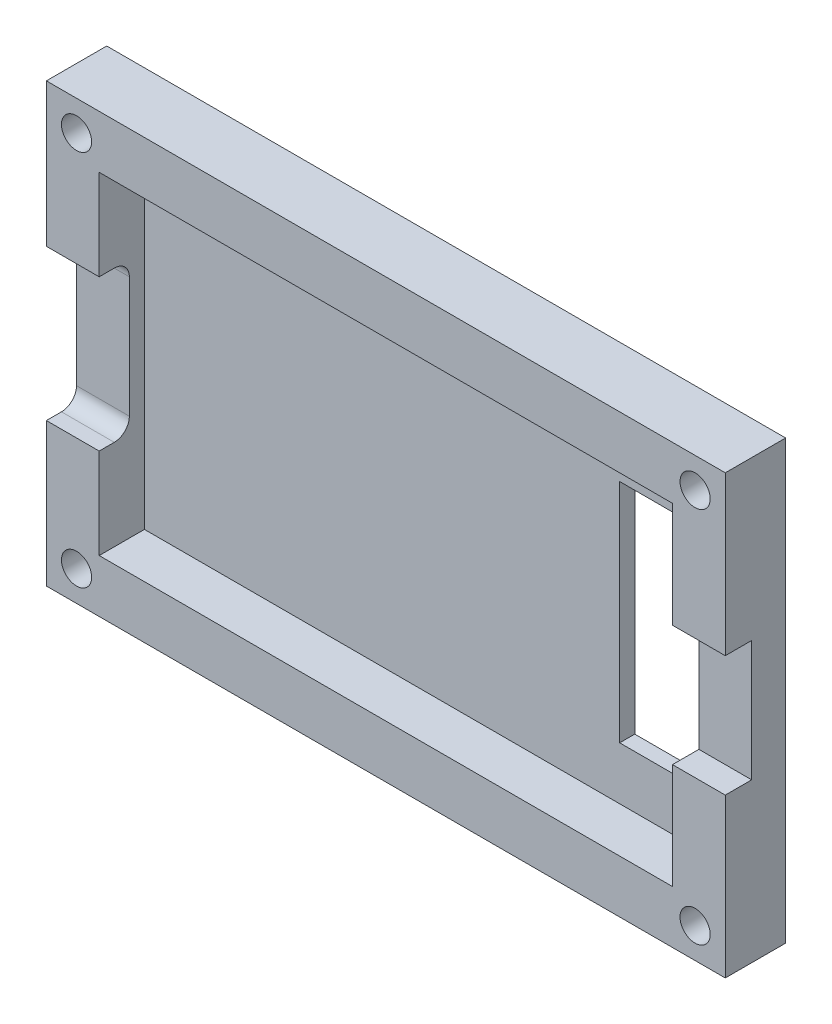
ISO-10303-21;
HEADER;
FILE_DESCRIPTION(('STEP AP214'),'2;1');
FILE_NAME('part.step','',(''),(''),'','','');
FILE_SCHEMA(('AUTOMOTIVE_DESIGN { 1 0 10303 214 1 1 1 1 }'));
ENDSEC;
DATA;
#1=APPLICATION_CONTEXT('core data for automotive mechanical design processes');
#2=APPLICATION_PROTOCOL_DEFINITION('international standard','automotive_design',2000,#1);
#3=PRODUCT_CONTEXT('',#1,'mechanical');
#4=PRODUCT('Part','Part','',(#3));
#5=PRODUCT_RELATED_PRODUCT_CATEGORY('part','',(#4));
#6=PRODUCT_DEFINITION_FORMATION('','',#4);
#7=PRODUCT_DEFINITION_CONTEXT('part definition',#1,'design');
#8=PRODUCT_DEFINITION('design','',#6,#7);
#9=PRODUCT_DEFINITION_SHAPE('','',#8);
#10=(LENGTH_UNIT() NAMED_UNIT(*) SI_UNIT(.MILLI.,.METRE.));
#11=(NAMED_UNIT(*) PLANE_ANGLE_UNIT() SI_UNIT($,.RADIAN.));
#12=(NAMED_UNIT(*) SI_UNIT($,.STERADIAN.) SOLID_ANGLE_UNIT());
#13=UNCERTAINTY_MEASURE_WITH_UNIT(LENGTH_MEASURE(1.E-05),#10,'distance_accuracy_value','');
#14=(GEOMETRIC_REPRESENTATION_CONTEXT(3) GLOBAL_UNCERTAINTY_ASSIGNED_CONTEXT((#13)) GLOBAL_UNIT_ASSIGNED_CONTEXT((#10,
#11,#12)) REPRESENTATION_CONTEXT('',''));
#15=CARTESIAN_POINT('',(0.,0.,0.));
#16=DIRECTION('',(0.,0.,1.));
#17=DIRECTION('',(1.,0.,0.));
#18=AXIS2_PLACEMENT_3D('',#15,#16,#17);
#19=CARTESIAN_POINT('',(0.,0.,4.));
#20=DIRECTION('',(0.,0.,-1.));
#21=DIRECTION('',(-1.,0.,0.));
#22=AXIS2_PLACEMENT_3D('',#19,#20,#21);
#23=PLANE('',#22);
#24=CARTESIAN_POINT('',(20.5,-12.5,4.));
#25=DIRECTION('',(0.,0.,1.));
#26=DIRECTION('',(1.,0.,0.));
#27=AXIS2_PLACEMENT_3D('',#24,#25,#26);
#28=CIRCLE('',#27,1.);
#29=CARTESIAN_POINT('',(21.5,-12.5,4.));
#30=VERTEX_POINT('',#29);
#31=EDGE_CURVE('E277',#30,#30,#28,.T.);
#32=ORIENTED_EDGE('',*,*,#31,.F.);
#33=EDGE_LOOP('',(#32));
#34=FACE_BOUND('',#33,.T.);
#35=CARTESIAN_POINT('',(-20.5,-12.5,4.));
#36=DIRECTION('',(0.,0.,1.));
#37=DIRECTION('',(-1.,0.,0.));
#38=AXIS2_PLACEMENT_3D('',#35,#36,#37);
#39=CIRCLE('',#38,1.);
#40=CARTESIAN_POINT('',(-21.5,-12.5,4.));
#41=VERTEX_POINT('',#40);
#42=EDGE_CURVE('E267',#41,#41,#39,.T.);
#43=ORIENTED_EDGE('',*,*,#42,.F.);
#44=EDGE_LOOP('',(#43));
#45=FACE_BOUND('',#44,.T.);
#46=DIRECTION('',(0.,1.,0.));
#47=VECTOR('',#46,1.);
#48=CARTESIAN_POINT('',(22.5,-14.5,4.));
#49=LINE('',#48,#47);
#50=CARTESIAN_POINT('',(22.5,-14.5,4.));
#51=VERTEX_POINT('',#50);
#52=CARTESIAN_POINT('',(22.5,-4.,4.));
#53=VERTEX_POINT('',#52);
#54=EDGE_CURVE('E362',#51,#53,#49,.T.);
#55=ORIENTED_EDGE('',*,*,#54,.T.);
#56=DIRECTION('',(-1.,0.,0.));
#57=VECTOR('',#56,1.);
#58=CARTESIAN_POINT('',(0.,-4.,4.));
#59=LINE('',#58,#57);
#60=CARTESIAN_POINT('',(19.,-4.,4.));
#61=VERTEX_POINT('',#60);
#62=EDGE_CURVE('E226',#53,#61,#59,.T.);
#63=ORIENTED_EDGE('',*,*,#62,.T.);
#64=DIRECTION('',(0.,1.,0.));
#65=VECTOR('',#64,1.);
#66=CARTESIAN_POINT('',(19.,-11.,4.));
#67=LINE('',#66,#65);
#68=CARTESIAN_POINT('',(19.,-11.,4.));
#69=VERTEX_POINT('',#68);
#70=EDGE_CURVE('E330',#69,#61,#67,.T.);
#71=ORIENTED_EDGE('',*,*,#70,.F.);
#72=DIRECTION('',(1.,0.,0.));
#73=VECTOR('',#72,1.);
#74=CARTESIAN_POINT('',(-19.,-11.,4.));
#75=LINE('',#74,#73);
#76=CARTESIAN_POINT('',(-19.,-11.,4.));
#77=VERTEX_POINT('',#76);
#78=EDGE_CURVE('E344',#77,#69,#75,.T.);
#79=ORIENTED_EDGE('',*,*,#78,.F.);
#80=DIRECTION('',(0.,-1.,0.));
#81=VECTOR('',#80,1.);
#82=CARTESIAN_POINT('',(-19.,-11.,4.));
#83=LINE('',#82,#81);
#84=CARTESIAN_POINT('',(-19.,-5.,4.));
#85=VERTEX_POINT('',#84);
#86=EDGE_CURVE('E339',#85,#77,#83,.T.);
#87=ORIENTED_EDGE('',*,*,#86,.F.);
#88=DIRECTION('',(-1.,0.,0.));
#89=VECTOR('',#88,1.);
#90=CARTESIAN_POINT('',(0.,-5.,4.));
#91=LINE('',#90,#89);
#92=CARTESIAN_POINT('',(-22.5,-5.,4.));
#93=VERTEX_POINT('',#92);
#94=EDGE_CURVE('E252',#85,#93,#91,.T.);
#95=ORIENTED_EDGE('',*,*,#94,.T.);
#96=DIRECTION('',(0.,-1.,0.));
#97=VECTOR('',#96,1.);
#98=CARTESIAN_POINT('',(-22.5,-14.5,4.));
#99=LINE('',#98,#97);
#100=CARTESIAN_POINT('',(-22.5,-14.5,4.));
#101=VERTEX_POINT('',#100);
#102=EDGE_CURVE('E369',#93,#101,#99,.T.);
#103=ORIENTED_EDGE('',*,*,#102,.T.);
#104=DIRECTION('',(1.,0.,0.));
#105=VECTOR('',#104,1.);
#106=CARTESIAN_POINT('',(-22.5,-14.5,4.));
#107=LINE('',#106,#105);
#108=EDGE_CURVE('E374',#101,#51,#107,.T.);
#109=ORIENTED_EDGE('',*,*,#108,.T.);
#110=EDGE_LOOP('',(#55,#63,#71,#79,#87,#95,#103,#109));
#111=FACE_BOUND('',#110,.T.);
#112=ADVANCED_FACE('F45',(#34,#45,#111),#23,.F.);
#113=CARTESIAN_POINT('',(22.5,-14.5,4.));
#114=DIRECTION('',(-1.,0.,0.));
#115=DIRECTION('',(0.,0.,1.));
#116=AXIS2_PLACEMENT_3D('',#113,#114,#115);
#117=PLANE('',#116);
#118=DIRECTION('',(0.,1.,0.));
#119=VECTOR('',#118,1.);
#120=CARTESIAN_POINT('',(22.5,4.,2.25));
#121=LINE('',#120,#119);
#122=CARTESIAN_POINT('',(22.5,-4.,2.25));
#123=VERTEX_POINT('',#122);
#124=CARTESIAN_POINT('',(22.5,4.,2.25));
#125=VERTEX_POINT('',#124);
#126=EDGE_CURVE('E206',#123,#125,#121,.T.);
#127=ORIENTED_EDGE('',*,*,#126,.F.);
#128=DIRECTION('',(0.,0.,-1.));
#129=VECTOR('',#128,1.);
#130=CARTESIAN_POINT('',(22.5,-4.,5.75));
#131=LINE('',#130,#129);
#132=EDGE_CURVE('E203',#53,#123,#131,.T.);
#133=ORIENTED_EDGE('',*,*,#132,.F.);
#134=ORIENTED_EDGE('',*,*,#54,.F.);
#135=DIRECTION('',(0.,0.,-1.));
#136=VECTOR('',#135,1.);
#137=CARTESIAN_POINT('',(22.5,-14.5,4.));
#138=LINE('',#137,#136);
#139=CARTESIAN_POINT('',(22.5,-14.5,0.));
#140=VERTEX_POINT('',#139);
#141=EDGE_CURVE('E377',#51,#140,#138,.T.);
#142=ORIENTED_EDGE('',*,*,#141,.T.);
#143=DIRECTION('',(0.,1.,0.));
#144=VECTOR('',#143,1.);
#145=CARTESIAN_POINT('',(22.5,-14.5,0.));
#146=LINE('',#145,#144);
#147=CARTESIAN_POINT('',(22.5,14.5,0.));
#148=VERTEX_POINT('',#147);
#149=EDGE_CURVE('E351',#140,#148,#146,.T.);
#150=ORIENTED_EDGE('',*,*,#149,.T.);
#151=DIRECTION('',(0.,0.,-1.));
#152=VECTOR('',#151,1.);
#153=CARTESIAN_POINT('',(22.5,14.5,4.));
#154=LINE('',#153,#152);
#155=CARTESIAN_POINT('',(22.5,14.5,4.));
#156=VERTEX_POINT('',#155);
#157=EDGE_CURVE('E401',#156,#148,#154,.T.);
#158=ORIENTED_EDGE('',*,*,#157,.F.);
#159=CARTESIAN_POINT('',(22.5,4.,4.));
#160=VERTEX_POINT('',#159);
#161=EDGE_CURVE('E216',#160,#156,#49,.T.);
#162=ORIENTED_EDGE('',*,*,#161,.F.);
#163=DIRECTION('',(0.,0.,1.));
#164=VECTOR('',#163,1.);
#165=CARTESIAN_POINT('',(22.5,4.,5.75));
#166=LINE('',#165,#164);
#167=EDGE_CURVE('E197',#125,#160,#166,.T.);
#168=ORIENTED_EDGE('',*,*,#167,.F.);
#169=EDGE_LOOP('',(#127,#133,#134,#142,#150,#158,#162,#168));
#170=FACE_BOUND('',#169,.T.);
#171=ADVANCED_FACE('F47',(#170),#117,.F.);
#172=CARTESIAN_POINT('',(-22.5,14.5,4.));
#173=DIRECTION('',(0.,-1.,0.));
#174=DIRECTION('',(0.,0.,-1.));
#175=AXIS2_PLACEMENT_3D('',#172,#173,#174);
#176=PLANE('',#175);
#177=DIRECTION('',(-1.,0.,0.));
#178=VECTOR('',#177,1.);
#179=CARTESIAN_POINT('',(-22.5,14.5,0.));
#180=LINE('',#179,#178);
#181=CARTESIAN_POINT('',(-22.5,14.5,0.));
#182=VERTEX_POINT('',#181);
#183=EDGE_CURVE('E381',#148,#182,#180,.T.);
#184=ORIENTED_EDGE('',*,*,#183,.T.);
#185=DIRECTION('',(0.,0.,-1.));
#186=VECTOR('',#185,1.);
#187=CARTESIAN_POINT('',(-22.5,14.5,4.));
#188=LINE('',#187,#186);
#189=CARTESIAN_POINT('',(-22.5,14.5,4.));
#190=VERTEX_POINT('',#189);
#191=EDGE_CURVE('E397',#190,#182,#188,.T.);
#192=ORIENTED_EDGE('',*,*,#191,.F.);
#193=DIRECTION('',(-1.,0.,0.));
#194=VECTOR('',#193,1.);
#195=CARTESIAN_POINT('',(-22.5,14.5,4.));
#196=LINE('',#195,#194);
#197=EDGE_CURVE('E366',#156,#190,#196,.T.);
#198=ORIENTED_EDGE('',*,*,#197,.F.);
#199=ORIENTED_EDGE('',*,*,#157,.T.);
#200=EDGE_LOOP('',(#184,#192,#198,#199));
#201=FACE_BOUND('',#200,.T.);
#202=ADVANCED_FACE('F476',(#201),#176,.F.);
#203=CARTESIAN_POINT('',(-22.5,-14.5,4.));
#204=DIRECTION('',(1.,0.,0.));
#205=DIRECTION('',(0.,0.,-1.));
#206=AXIS2_PLACEMENT_3D('',#203,#204,#205);
#207=PLANE('',#206);
#208=CARTESIAN_POINT('',(-22.5,4.,3.));
#209=DIRECTION('',(-1.,0.,0.));
#210=DIRECTION('',(0.,0.,1.));
#211=AXIS2_PLACEMENT_3D('',#208,#209,#210);
#212=CIRCLE('',#211,1.);
#213=CARTESIAN_POINT('',(-22.5,5.,3.00000000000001));
#214=VERTEX_POINT('',#213);
#215=CARTESIAN_POINT('',(-22.5,3.99999999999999,2.));
#216=VERTEX_POINT('',#215);
#217=EDGE_CURVE('E230',#214,#216,#212,.T.);
#218=ORIENTED_EDGE('',*,*,#217,.F.);
#219=DIRECTION('',(0.,0.,-1.));
#220=VECTOR('',#219,1.);
#221=CARTESIAN_POINT('',(-22.5,5.,3.00000000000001));
#222=LINE('',#221,#220);
#223=CARTESIAN_POINT('',(-22.5,5.,4.));
#224=VERTEX_POINT('',#223);
#225=EDGE_CURVE('E244',#224,#214,#222,.T.);
#226=ORIENTED_EDGE('',*,*,#225,.F.);
#227=EDGE_CURVE('E370',#190,#224,#99,.T.);
#228=ORIENTED_EDGE('',*,*,#227,.F.);
#229=ORIENTED_EDGE('',*,*,#191,.T.);
#230=DIRECTION('',(0.,-1.,0.));
#231=VECTOR('',#230,1.);
#232=CARTESIAN_POINT('',(-22.5,-14.5,0.));
#233=LINE('',#232,#231);
#234=CARTESIAN_POINT('',(-22.5,-14.5,0.));
#235=VERTEX_POINT('',#234);
#236=EDGE_CURVE('E384',#182,#235,#233,.T.);
#237=ORIENTED_EDGE('',*,*,#236,.T.);
#238=DIRECTION('',(0.,0.,-1.));
#239=VECTOR('',#238,1.);
#240=CARTESIAN_POINT('',(-22.5,-14.5,4.));
#241=LINE('',#240,#239);
#242=EDGE_CURVE('E393',#101,#235,#241,.T.);
#243=ORIENTED_EDGE('',*,*,#242,.F.);
#244=ORIENTED_EDGE('',*,*,#102,.F.);
#245=DIRECTION('',(0.,0.,1.));
#246=VECTOR('',#245,1.);
#247=CARTESIAN_POINT('',(-22.5,-5.,3.00000000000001));
#248=LINE('',#247,#246);
#249=CARTESIAN_POINT('',(-22.5,-5.,3.00000000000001));
#250=VERTEX_POINT('',#249);
#251=EDGE_CURVE('E241',#250,#93,#248,.T.);
#252=ORIENTED_EDGE('',*,*,#251,.F.);
#253=CARTESIAN_POINT('',(-22.5,-4.,3.));
#254=DIRECTION('',(-1.,0.,0.));
#255=DIRECTION('',(0.,0.,1.));
#256=AXIS2_PLACEMENT_3D('',#253,#254,#255);
#257=CIRCLE('',#256,1.);
#258=CARTESIAN_POINT('',(-22.5,-3.99999999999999,2.));
#259=VERTEX_POINT('',#258);
#260=EDGE_CURVE('E237',#259,#250,#257,.T.);
#261=ORIENTED_EDGE('',*,*,#260,.F.);
#262=DIRECTION('',(0.,-1.,0.));
#263=VECTOR('',#262,1.);
#264=CARTESIAN_POINT('',(-22.5,-3.99999999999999,2.));
#265=LINE('',#264,#263);
#266=EDGE_CURVE('E234',#216,#259,#265,.T.);
#267=ORIENTED_EDGE('',*,*,#266,.F.);
#268=EDGE_LOOP('',(#218,#226,#228,#229,#237,#243,#244,#252,#261,#267));
#269=FACE_BOUND('',#268,.T.);
#270=ADVANCED_FACE('F525',(#269),#207,.F.);
#271=CARTESIAN_POINT('',(-22.5,-14.5,4.));
#272=DIRECTION('',(0.,1.,0.));
#273=DIRECTION('',(0.,0.,1.));
#274=AXIS2_PLACEMENT_3D('',#271,#272,#273);
#275=PLANE('',#274);
#276=DIRECTION('',(1.,0.,0.));
#277=VECTOR('',#276,1.);
#278=CARTESIAN_POINT('',(-22.5,-14.5,0.));
#279=LINE('',#278,#277);
#280=EDGE_CURVE('E387',#235,#140,#279,.T.);
#281=ORIENTED_EDGE('',*,*,#280,.T.);
#282=ORIENTED_EDGE('',*,*,#141,.F.);
#283=ORIENTED_EDGE('',*,*,#108,.F.);
#284=ORIENTED_EDGE('',*,*,#242,.T.);
#285=EDGE_LOOP('',(#281,#282,#283,#284));
#286=FACE_BOUND('',#285,.T.);
#287=ADVANCED_FACE('F467',(#286),#275,.F.);
#288=CARTESIAN_POINT('',(20.5,12.5,4.));
#289=DIRECTION('',(0.,0.,1.));
#290=DIRECTION('',(-1.,0.,0.));
#291=AXIS2_PLACEMENT_3D('',#288,#289,#290);
#292=CIRCLE('',#291,1.);
#293=CARTESIAN_POINT('',(19.5,12.5,4.));
#294=VERTEX_POINT('',#293);
#295=EDGE_CURVE('E273',#294,#294,#292,.T.);
#296=ORIENTED_EDGE('',*,*,#295,.F.);
#297=EDGE_LOOP('',(#296));
#298=FACE_BOUND('',#297,.T.);
#299=CARTESIAN_POINT('',(-20.5,12.5,4.));
#300=DIRECTION('',(0.,0.,1.));
#301=DIRECTION('',(1.,0.,0.));
#302=AXIS2_PLACEMENT_3D('',#299,#300,#301);
#303=CIRCLE('',#302,1.);
#304=CARTESIAN_POINT('',(-19.5,12.5,4.));
#305=VERTEX_POINT('',#304);
#306=EDGE_CURVE('E268',#305,#305,#303,.T.);
#307=ORIENTED_EDGE('',*,*,#306,.F.);
#308=EDGE_LOOP('',(#307));
#309=FACE_BOUND('',#308,.T.);
#310=CARTESIAN_POINT('',(19.,4.,4.));
#311=VERTEX_POINT('',#310);
#312=CARTESIAN_POINT('',(19.,11.,4.));
#313=VERTEX_POINT('',#312);
#314=EDGE_CURVE('E335',#311,#313,#67,.T.);
#315=ORIENTED_EDGE('',*,*,#314,.F.);
#316=DIRECTION('',(1.,0.,0.));
#317=VECTOR('',#316,1.);
#318=CARTESIAN_POINT('',(0.,4.,4.));
#319=LINE('',#318,#317);
#320=EDGE_CURVE('E61',#311,#160,#319,.T.);
#321=ORIENTED_EDGE('',*,*,#320,.T.);
#322=ORIENTED_EDGE('',*,*,#161,.T.);
#323=ORIENTED_EDGE('',*,*,#197,.T.);
#324=ORIENTED_EDGE('',*,*,#227,.T.);
#325=DIRECTION('',(1.,0.,0.));
#326=VECTOR('',#325,1.);
#327=CARTESIAN_POINT('',(0.,5.,4.));
#328=LINE('',#327,#326);
#329=CARTESIAN_POINT('',(-19.,5.,4.));
#330=VERTEX_POINT('',#329);
#331=EDGE_CURVE('E263',#224,#330,#328,.T.);
#332=ORIENTED_EDGE('',*,*,#331,.T.);
#333=CARTESIAN_POINT('',(-19.,11.,4.));
#334=VERTEX_POINT('',#333);
#335=EDGE_CURVE('E340',#334,#330,#83,.T.);
#336=ORIENTED_EDGE('',*,*,#335,.F.);
#337=DIRECTION('',(-1.,0.,0.));
#338=VECTOR('',#337,1.);
#339=CARTESIAN_POINT('',(-19.,11.,4.));
#340=LINE('',#339,#338);
#341=EDGE_CURVE('E334',#313,#334,#340,.T.);
#342=ORIENTED_EDGE('',*,*,#341,.F.);
#343=EDGE_LOOP('',(#315,#321,#322,#323,#324,#332,#336,#342));
#344=FACE_BOUND('',#343,.T.);
#345=ADVANCED_FACE('F479',(#298,#309,#344),#23,.F.);
#346=CARTESIAN_POINT('',(0.,0.,0.));
#347=DIRECTION('',(0.,0.,-1.));
#348=DIRECTION('',(-1.,0.,0.));
#349=AXIS2_PLACEMENT_3D('',#346,#347,#348);
#350=PLANE('',#349);
#351=CARTESIAN_POINT('',(-20.5,-12.5,0.));
#352=DIRECTION('',(0.,0.,-1.));
#353=DIRECTION('',(-1.,0.,0.));
#354=AXIS2_PLACEMENT_3D('',#351,#352,#353);
#355=CIRCLE('',#354,1.);
#356=CARTESIAN_POINT('',(-21.5,-12.5,0.));
#357=VERTEX_POINT('',#356);
#358=EDGE_CURVE('E429',#357,#357,#355,.T.);
#359=ORIENTED_EDGE('',*,*,#358,.F.);
#360=EDGE_LOOP('',(#359));
#361=FACE_BOUND('',#360,.T.);
#362=CARTESIAN_POINT('',(20.5,-12.5,0.));
#363=DIRECTION('',(0.,0.,-1.));
#364=DIRECTION('',(-1.,0.,0.));
#365=AXIS2_PLACEMENT_3D('',#362,#363,#364);
#366=CIRCLE('',#365,1.);
#367=CARTESIAN_POINT('',(19.5,-12.5,0.));
#368=VERTEX_POINT('',#367);
#369=EDGE_CURVE('E425',#368,#368,#366,.T.);
#370=ORIENTED_EDGE('',*,*,#369,.F.);
#371=EDGE_LOOP('',(#370));
#372=FACE_BOUND('',#371,.T.);
#373=CARTESIAN_POINT('',(20.5,12.5,0.));
#374=DIRECTION('',(0.,0.,-1.));
#375=DIRECTION('',(-1.,0.,0.));
#376=AXIS2_PLACEMENT_3D('',#373,#374,#375);
#377=CIRCLE('',#376,1.);
#378=CARTESIAN_POINT('',(19.5,12.5,0.));
#379=VERTEX_POINT('',#378);
#380=EDGE_CURVE('E421',#379,#379,#377,.T.);
#381=ORIENTED_EDGE('',*,*,#380,.F.);
#382=EDGE_LOOP('',(#381));
#383=FACE_BOUND('',#382,.T.);
#384=CARTESIAN_POINT('',(-20.5,12.5,0.));
#385=DIRECTION('',(0.,0.,-1.));
#386=DIRECTION('',(-1.,0.,0.));
#387=AXIS2_PLACEMENT_3D('',#384,#385,#386);
#388=CIRCLE('',#387,1.);
#389=CARTESIAN_POINT('',(-21.5,12.5,0.));
#390=VERTEX_POINT('',#389);
#391=EDGE_CURVE('E311',#390,#390,#388,.T.);
#392=ORIENTED_EDGE('',*,*,#391,.F.);
#393=EDGE_LOOP('',(#392));
#394=FACE_BOUND('',#393,.T.);
#395=DIRECTION('',(0.,-1.,0.));
#396=VECTOR('',#395,1.);
#397=CARTESIAN_POINT('',(19.,0.,0.));
#398=LINE('',#397,#396);
#399=CARTESIAN_POINT('',(19.,7.5,0.));
#400=VERTEX_POINT('',#399);
#401=CARTESIAN_POINT('',(19.,-7.5,0.));
#402=VERTEX_POINT('',#401);
#403=EDGE_CURVE('E308',#400,#402,#398,.T.);
#404=ORIENTED_EDGE('',*,*,#403,.F.);
#405=DIRECTION('',(1.,0.,0.));
#406=VECTOR('',#405,1.);
#407=CARTESIAN_POINT('',(0.,7.5,0.));
#408=LINE('',#407,#406);
#409=CARTESIAN_POINT('',(12.5,7.5,0.));
#410=VERTEX_POINT('',#409);
#411=EDGE_CURVE('E288',#410,#400,#408,.T.);
#412=ORIENTED_EDGE('',*,*,#411,.F.);
#413=DIRECTION('',(0.,1.,0.));
#414=VECTOR('',#413,1.);
#415=CARTESIAN_POINT('',(12.5,0.,0.));
#416=LINE('',#415,#414);
#417=CARTESIAN_POINT('',(12.5,-7.5,0.));
#418=VERTEX_POINT('',#417);
#419=EDGE_CURVE('E301',#418,#410,#416,.T.);
#420=ORIENTED_EDGE('',*,*,#419,.F.);
#421=DIRECTION('',(-1.,0.,0.));
#422=VECTOR('',#421,1.);
#423=CARTESIAN_POINT('',(0.,-7.5,0.));
#424=LINE('',#423,#422);
#425=EDGE_CURVE('E305',#402,#418,#424,.T.);
#426=ORIENTED_EDGE('',*,*,#425,.F.);
#427=EDGE_LOOP('',(#404,#412,#420,#426));
#428=FACE_BOUND('',#427,.T.);
#429=ORIENTED_EDGE('',*,*,#149,.F.);
#430=ORIENTED_EDGE('',*,*,#280,.F.);
#431=ORIENTED_EDGE('',*,*,#236,.F.);
#432=ORIENTED_EDGE('',*,*,#183,.F.);
#433=EDGE_LOOP('',(#429,#430,#431,#432));
#434=FACE_BOUND('',#433,.T.);
#435=ADVANCED_FACE('F471',(#361,#372,#383,#394,#428,#434),#350,.T.);
#436=CARTESIAN_POINT('',(19.,-11.,1.));
#437=DIRECTION('',(1.,0.,0.));
#438=DIRECTION('',(0.,0.,-1.));
#439=AXIS2_PLACEMENT_3D('',#436,#437,#438);
#440=PLANE('',#439);
#441=ORIENTED_EDGE('',*,*,#70,.T.);
#442=DIRECTION('',(0.,0.,-1.));
#443=VECTOR('',#442,1.);
#444=CARTESIAN_POINT('',(19.,-4.,1.));
#445=LINE('',#444,#443);
#446=CARTESIAN_POINT('',(19.,-4.,2.25));
#447=VERTEX_POINT('',#446);
#448=EDGE_CURVE('E11',#61,#447,#445,.T.);
#449=ORIENTED_EDGE('',*,*,#448,.T.);
#450=DIRECTION('',(0.,1.,0.));
#451=VECTOR('',#450,1.);
#452=CARTESIAN_POINT('',(19.,-11.,2.25));
#453=LINE('',#452,#451);
#454=CARTESIAN_POINT('',(19.,4.,2.25));
#455=VERTEX_POINT('',#454);
#456=EDGE_CURVE('E54',#447,#455,#453,.T.);
#457=ORIENTED_EDGE('',*,*,#456,.T.);
#458=DIRECTION('',(0.,0.,1.));
#459=VECTOR('',#458,1.);
#460=CARTESIAN_POINT('',(19.,4.,1.));
#461=LINE('',#460,#459);
#462=EDGE_CURVE('E198',#455,#311,#461,.T.);
#463=ORIENTED_EDGE('',*,*,#462,.T.);
#464=ORIENTED_EDGE('',*,*,#314,.T.);
#465=DIRECTION('',(0.,0.,1.));
#466=VECTOR('',#465,1.);
#467=CARTESIAN_POINT('',(19.,11.,1.));
#468=LINE('',#467,#466);
#469=CARTESIAN_POINT('',(19.,11.,1.));
#470=VERTEX_POINT('',#469);
#471=EDGE_CURVE('E329',#470,#313,#468,.T.);
#472=ORIENTED_EDGE('',*,*,#471,.F.);
#473=DIRECTION('',(0.,1.,0.));
#474=VECTOR('',#473,1.);
#475=CARTESIAN_POINT('',(19.,-11.,1.));
#476=LINE('',#475,#474);
#477=CARTESIAN_POINT('',(19.,7.5,1.));
#478=VERTEX_POINT('',#477);
#479=EDGE_CURVE('E317',#478,#470,#476,.T.);
#480=ORIENTED_EDGE('',*,*,#479,.F.);
#481=DIRECTION('',(0.,0.,1.));
#482=VECTOR('',#481,1.);
#483=CARTESIAN_POINT('',(19.,7.5,-8.));
#484=LINE('',#483,#482);
#485=EDGE_CURVE('E272',#400,#478,#484,.T.);
#486=ORIENTED_EDGE('',*,*,#485,.F.);
#487=ORIENTED_EDGE('',*,*,#403,.T.);
#488=DIRECTION('',(0.,0.,1.));
#489=VECTOR('',#488,1.);
#490=CARTESIAN_POINT('',(19.,-7.5,-8.));
#491=LINE('',#490,#489);
#492=CARTESIAN_POINT('',(19.,-7.5,1.));
#493=VERTEX_POINT('',#492);
#494=EDGE_CURVE('E284',#402,#493,#491,.T.);
#495=ORIENTED_EDGE('',*,*,#494,.T.);
#496=CARTESIAN_POINT('',(19.,-11.,1.));
#497=VERTEX_POINT('',#496);
#498=EDGE_CURVE('E312',#497,#493,#476,.T.);
#499=ORIENTED_EDGE('',*,*,#498,.F.);
#500=DIRECTION('',(0.,0.,1.));
#501=VECTOR('',#500,1.);
#502=CARTESIAN_POINT('',(19.,-11.,1.));
#503=LINE('',#502,#501);
#504=EDGE_CURVE('E348',#497,#69,#503,.T.);
#505=ORIENTED_EDGE('',*,*,#504,.T.);
#506=EDGE_LOOP('',(#441,#449,#457,#463,#464,#472,#480,#486,#487,#495,#499,#505));
#507=FACE_BOUND('',#506,.T.);
#508=ADVANCED_FACE('F455',(#507),#440,.F.);
#509=CARTESIAN_POINT('',(-19.,-11.,1.));
#510=DIRECTION('',(0.,-1.,0.));
#511=DIRECTION('',(0.,0.,-1.));
#512=AXIS2_PLACEMENT_3D('',#509,#510,#511);
#513=PLANE('',#512);
#514=ORIENTED_EDGE('',*,*,#78,.T.);
#515=ORIENTED_EDGE('',*,*,#504,.F.);
#516=DIRECTION('',(1.,0.,0.));
#517=VECTOR('',#516,1.);
#518=CARTESIAN_POINT('',(-19.,-11.,1.));
#519=LINE('',#518,#517);
#520=CARTESIAN_POINT('',(-19.,-11.,1.));
#521=VERTEX_POINT('',#520);
#522=EDGE_CURVE('E325',#521,#497,#519,.T.);
#523=ORIENTED_EDGE('',*,*,#522,.F.);
#524=DIRECTION('',(0.,0.,1.));
#525=VECTOR('',#524,1.);
#526=CARTESIAN_POINT('',(-19.,-11.,1.));
#527=LINE('',#526,#525);
#528=EDGE_CURVE('E352',#521,#77,#527,.T.);
#529=ORIENTED_EDGE('',*,*,#528,.T.);
#530=EDGE_LOOP('',(#514,#515,#523,#529));
#531=FACE_BOUND('',#530,.T.);
#532=ADVANCED_FACE('F512',(#531),#513,.F.);
#533=CARTESIAN_POINT('',(-19.,-11.,1.));
#534=DIRECTION('',(-1.,0.,0.));
#535=DIRECTION('',(0.,0.,1.));
#536=AXIS2_PLACEMENT_3D('',#533,#534,#535);
#537=PLANE('',#536);
#538=ORIENTED_EDGE('',*,*,#335,.T.);
#539=DIRECTION('',(0.,0.,-1.));
#540=VECTOR('',#539,1.);
#541=CARTESIAN_POINT('',(-19.,5.,1.));
#542=LINE('',#541,#540);
#543=CARTESIAN_POINT('',(-19.,5.,3.00000000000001));
#544=VERTEX_POINT('',#543);
#545=EDGE_CURVE('E448',#330,#544,#542,.T.);
#546=ORIENTED_EDGE('',*,*,#545,.T.);
#547=CARTESIAN_POINT('',(-19.,4.,3.));
#548=DIRECTION('',(-1.,0.,0.));
#549=DIRECTION('',(0.,0.,1.));
#550=AXIS2_PLACEMENT_3D('',#547,#548,#549);
#551=CIRCLE('',#550,1.);
#552=CARTESIAN_POINT('',(-19.,3.99999999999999,2.));
#553=VERTEX_POINT('',#552);
#554=EDGE_CURVE('E444',#544,#553,#551,.T.);
#555=ORIENTED_EDGE('',*,*,#554,.T.);
#556=DIRECTION('',(0.,-1.,0.));
#557=VECTOR('',#556,1.);
#558=CARTESIAN_POINT('',(-19.,-11.,2.));
#559=LINE('',#558,#557);
#560=CARTESIAN_POINT('',(-19.,-3.99999999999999,2.));
#561=VERTEX_POINT('',#560);
#562=EDGE_CURVE('E417',#553,#561,#559,.T.);
#563=ORIENTED_EDGE('',*,*,#562,.T.);
#564=CARTESIAN_POINT('',(-19.,-4.,3.));
#565=DIRECTION('',(-1.,0.,0.));
#566=DIRECTION('',(0.,0.,1.));
#567=AXIS2_PLACEMENT_3D('',#564,#565,#566);
#568=CIRCLE('',#567,1.);
#569=CARTESIAN_POINT('',(-19.,-5.,3.00000000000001));
#570=VERTEX_POINT('',#569);
#571=EDGE_CURVE('E436',#561,#570,#568,.T.);
#572=ORIENTED_EDGE('',*,*,#571,.T.);
#573=DIRECTION('',(0.,0.,1.));
#574=VECTOR('',#573,1.);
#575=CARTESIAN_POINT('',(-19.,-5.,1.));
#576=LINE('',#575,#574);
#577=EDGE_CURVE('E440',#570,#85,#576,.T.);
#578=ORIENTED_EDGE('',*,*,#577,.T.);
#579=ORIENTED_EDGE('',*,*,#86,.T.);
#580=ORIENTED_EDGE('',*,*,#528,.F.);
#581=DIRECTION('',(0.,-1.,0.));
#582=VECTOR('',#581,1.);
#583=CARTESIAN_POINT('',(-19.,-11.,1.));
#584=LINE('',#583,#582);
#585=CARTESIAN_POINT('',(-19.,11.,1.));
#586=VERTEX_POINT('',#585);
#587=EDGE_CURVE('E321',#586,#521,#584,.T.);
#588=ORIENTED_EDGE('',*,*,#587,.F.);
#589=DIRECTION('',(0.,0.,1.));
#590=VECTOR('',#589,1.);
#591=CARTESIAN_POINT('',(-19.,11.,1.));
#592=LINE('',#591,#590);
#593=EDGE_CURVE('E356',#586,#334,#592,.T.);
#594=ORIENTED_EDGE('',*,*,#593,.T.);
#595=EDGE_LOOP('',(#538,#546,#555,#563,#572,#578,#579,#580,#588,#594));
#596=FACE_BOUND('',#595,.T.);
#597=ADVANCED_FACE('F492',(#596),#537,.F.);
#598=CARTESIAN_POINT('',(-19.,11.,1.));
#599=DIRECTION('',(0.,1.,0.));
#600=DIRECTION('',(0.,0.,1.));
#601=AXIS2_PLACEMENT_3D('',#598,#599,#600);
#602=PLANE('',#601);
#603=ORIENTED_EDGE('',*,*,#341,.T.);
#604=ORIENTED_EDGE('',*,*,#593,.F.);
#605=DIRECTION('',(-1.,0.,0.));
#606=VECTOR('',#605,1.);
#607=CARTESIAN_POINT('',(-19.,11.,1.));
#608=LINE('',#607,#606);
#609=EDGE_CURVE('E316',#470,#586,#608,.T.);
#610=ORIENTED_EDGE('',*,*,#609,.F.);
#611=ORIENTED_EDGE('',*,*,#471,.T.);
#612=EDGE_LOOP('',(#603,#604,#610,#611));
#613=FACE_BOUND('',#612,.T.);
#614=ADVANCED_FACE('F489',(#613),#602,.F.);
#615=CARTESIAN_POINT('',(0.,0.,1.));
#616=DIRECTION('',(0.,0.,-1.));
#617=DIRECTION('',(-1.,0.,0.));
#618=AXIS2_PLACEMENT_3D('',#615,#616,#617);
#619=PLANE('',#618);
#620=ORIENTED_EDGE('',*,*,#498,.T.);
#621=DIRECTION('',(-1.,0.,0.));
#622=VECTOR('',#621,1.);
#623=CARTESIAN_POINT('',(0.,-7.5,1.));
#624=LINE('',#623,#622);
#625=CARTESIAN_POINT('',(12.5,-7.5,1.));
#626=VERTEX_POINT('',#625);
#627=EDGE_CURVE('E413',#493,#626,#624,.T.);
#628=ORIENTED_EDGE('',*,*,#627,.T.);
#629=DIRECTION('',(0.,1.,0.));
#630=VECTOR('',#629,1.);
#631=CARTESIAN_POINT('',(12.5,0.,1.));
#632=LINE('',#631,#630);
#633=CARTESIAN_POINT('',(12.5,7.5,1.));
#634=VERTEX_POINT('',#633);
#635=EDGE_CURVE('E409',#626,#634,#632,.T.);
#636=ORIENTED_EDGE('',*,*,#635,.T.);
#637=DIRECTION('',(1.,0.,0.));
#638=VECTOR('',#637,1.);
#639=CARTESIAN_POINT('',(0.,7.5,1.));
#640=LINE('',#639,#638);
#641=EDGE_CURVE('E405',#634,#478,#640,.T.);
#642=ORIENTED_EDGE('',*,*,#641,.T.);
#643=ORIENTED_EDGE('',*,*,#479,.T.);
#644=ORIENTED_EDGE('',*,*,#609,.T.);
#645=ORIENTED_EDGE('',*,*,#587,.T.);
#646=ORIENTED_EDGE('',*,*,#522,.T.);
#647=EDGE_LOOP('',(#620,#628,#636,#642,#643,#644,#645,#646));
#648=FACE_BOUND('',#647,.T.);
#649=ADVANCED_FACE('F496',(#648),#619,.F.);
#650=CARTESIAN_POINT('',(12.5,-7.5,-8.));
#651=DIRECTION('',(0.,-1.,0.));
#652=DIRECTION('',(0.,0.,-1.));
#653=AXIS2_PLACEMENT_3D('',#650,#651,#652);
#654=PLANE('',#653);
#655=ORIENTED_EDGE('',*,*,#425,.T.);
#656=DIRECTION('',(0.,0.,1.));
#657=VECTOR('',#656,1.);
#658=CARTESIAN_POINT('',(12.5,-7.5,-8.));
#659=LINE('',#658,#657);
#660=EDGE_CURVE('E289',#418,#626,#659,.T.);
#661=ORIENTED_EDGE('',*,*,#660,.T.);
#662=ORIENTED_EDGE('',*,*,#627,.F.);
#663=ORIENTED_EDGE('',*,*,#494,.F.);
#664=EDGE_LOOP('',(#655,#661,#662,#663));
#665=FACE_BOUND('',#664,.T.);
#666=ADVANCED_FACE('F507',(#665),#654,.F.);
#667=CARTESIAN_POINT('',(12.5,-7.5,-8.));
#668=DIRECTION('',(-1.,0.,0.));
#669=DIRECTION('',(0.,0.,1.));
#670=AXIS2_PLACEMENT_3D('',#667,#668,#669);
#671=PLANE('',#670);
#672=ORIENTED_EDGE('',*,*,#419,.T.);
#673=DIRECTION('',(0.,0.,1.));
#674=VECTOR('',#673,1.);
#675=CARTESIAN_POINT('',(12.5,7.5,-8.));
#676=LINE('',#675,#674);
#677=EDGE_CURVE('E293',#410,#634,#676,.T.);
#678=ORIENTED_EDGE('',*,*,#677,.T.);
#679=ORIENTED_EDGE('',*,*,#635,.F.);
#680=ORIENTED_EDGE('',*,*,#660,.F.);
#681=EDGE_LOOP('',(#672,#678,#679,#680));
#682=FACE_BOUND('',#681,.T.);
#683=ADVANCED_FACE('F509',(#682),#671,.F.);
#684=CARTESIAN_POINT('',(12.5,7.5,-8.));
#685=DIRECTION('',(0.,1.,0.));
#686=DIRECTION('',(0.,0.,1.));
#687=AXIS2_PLACEMENT_3D('',#684,#685,#686);
#688=PLANE('',#687);
#689=ORIENTED_EDGE('',*,*,#411,.T.);
#690=ORIENTED_EDGE('',*,*,#485,.T.);
#691=ORIENTED_EDGE('',*,*,#641,.F.);
#692=ORIENTED_EDGE('',*,*,#677,.F.);
#693=EDGE_LOOP('',(#689,#690,#691,#692));
#694=FACE_BOUND('',#693,.T.);
#695=ADVANCED_FACE('F570',(#694),#688,.F.);
#696=CARTESIAN_POINT('',(-20.5,12.5,-8.));
#697=DIRECTION('',(0.,0.,1.));
#698=DIRECTION('',(1.,0.,0.));
#699=AXIS2_PLACEMENT_3D('',#696,#697,#698);
#700=CYLINDRICAL_SURFACE('',#699,1.);
#701=ORIENTED_EDGE('',*,*,#391,.T.);
#702=EDGE_LOOP('',(#701));
#703=FACE_BOUND('',#702,.T.);
#704=ORIENTED_EDGE('',*,*,#306,.T.);
#705=EDGE_LOOP('',(#704));
#706=FACE_BOUND('',#705,.T.);
#707=ADVANCED_FACE('F567',(#703,#706),#700,.F.);
#708=CARTESIAN_POINT('',(20.5,12.5,-8.));
#709=DIRECTION('',(0.,0.,1.));
#710=DIRECTION('',(1.,0.,0.));
#711=AXIS2_PLACEMENT_3D('',#708,#709,#710);
#712=CYLINDRICAL_SURFACE('',#711,1.);
#713=ORIENTED_EDGE('',*,*,#380,.T.);
#714=EDGE_LOOP('',(#713));
#715=FACE_BOUND('',#714,.T.);
#716=ORIENTED_EDGE('',*,*,#295,.T.);
#717=EDGE_LOOP('',(#716));
#718=FACE_BOUND('',#717,.T.);
#719=ADVANCED_FACE('F569',(#715,#718),#712,.F.);
#720=CARTESIAN_POINT('',(20.5,-12.5,-8.));
#721=DIRECTION('',(0.,0.,1.));
#722=DIRECTION('',(1.,0.,0.));
#723=AXIS2_PLACEMENT_3D('',#720,#721,#722);
#724=CYLINDRICAL_SURFACE('',#723,1.);
#725=ORIENTED_EDGE('',*,*,#369,.T.);
#726=EDGE_LOOP('',(#725));
#727=FACE_BOUND('',#726,.T.);
#728=ORIENTED_EDGE('',*,*,#31,.T.);
#729=EDGE_LOOP('',(#728));
#730=FACE_BOUND('',#729,.T.);
#731=ADVANCED_FACE('F577',(#727,#730),#724,.F.);
#732=CARTESIAN_POINT('',(-20.5,-12.5,-8.));
#733=DIRECTION('',(0.,0.,1.));
#734=DIRECTION('',(1.,0.,0.));
#735=AXIS2_PLACEMENT_3D('',#732,#733,#734);
#736=CYLINDRICAL_SURFACE('',#735,1.);
#737=ORIENTED_EDGE('',*,*,#358,.T.);
#738=EDGE_LOOP('',(#737));
#739=FACE_BOUND('',#738,.T.);
#740=ORIENTED_EDGE('',*,*,#42,.T.);
#741=EDGE_LOOP('',(#740));
#742=FACE_BOUND('',#741,.T.);
#743=ADVANCED_FACE('F584',(#739,#742),#736,.F.);
#744=CARTESIAN_POINT('',(-10.5,4.,3.));
#745=DIRECTION('',(-1.,0.,0.));
#746=DIRECTION('',(0.,0.,1.));
#747=AXIS2_PLACEMENT_3D('',#744,#745,#746);
#748=CYLINDRICAL_SURFACE('',#747,1.);
#749=DIRECTION('',(-1.,0.,0.));
#750=VECTOR('',#749,1.);
#751=CARTESIAN_POINT('',(-10.5,5.,3.00000000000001));
#752=LINE('',#751,#750);
#753=EDGE_CURVE('E249',#544,#214,#752,.T.);
#754=ORIENTED_EDGE('',*,*,#753,.T.);
#755=ORIENTED_EDGE('',*,*,#217,.T.);
#756=DIRECTION('',(-1.,0.,0.));
#757=VECTOR('',#756,1.);
#758=CARTESIAN_POINT('',(-10.5,3.99999999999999,2.));
#759=LINE('',#758,#757);
#760=EDGE_CURVE('E248',#553,#216,#759,.T.);
#761=ORIENTED_EDGE('',*,*,#760,.F.);
#762=ORIENTED_EDGE('',*,*,#554,.F.);
#763=EDGE_LOOP('',(#754,#755,#761,#762));
#764=FACE_BOUND('',#763,.T.);
#765=ADVANCED_FACE('F532',(#764),#748,.F.);
#766=CARTESIAN_POINT('',(-10.5,5.,3.00000000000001));
#767=DIRECTION('',(0.,1.,0.));
#768=DIRECTION('',(0.,0.,1.));
#769=AXIS2_PLACEMENT_3D('',#766,#767,#768);
#770=PLANE('',#769);
#771=ORIENTED_EDGE('',*,*,#225,.T.);
#772=ORIENTED_EDGE('',*,*,#753,.F.);
#773=ORIENTED_EDGE('',*,*,#545,.F.);
#774=ORIENTED_EDGE('',*,*,#331,.F.);
#775=EDGE_LOOP('',(#771,#772,#773,#774));
#776=FACE_BOUND('',#775,.T.);
#777=ADVANCED_FACE('F530',(#776),#770,.F.);
#778=CARTESIAN_POINT('',(-10.5,-5.,3.00000000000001));
#779=DIRECTION('',(0.,-1.,0.));
#780=DIRECTION('',(0.,0.,-1.));
#781=AXIS2_PLACEMENT_3D('',#778,#779,#780);
#782=PLANE('',#781);
#783=ORIENTED_EDGE('',*,*,#577,.F.);
#784=DIRECTION('',(-1.,0.,0.));
#785=VECTOR('',#784,1.);
#786=CARTESIAN_POINT('',(-10.5,-5.,3.00000000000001));
#787=LINE('',#786,#785);
#788=EDGE_CURVE('E253',#570,#250,#787,.T.);
#789=ORIENTED_EDGE('',*,*,#788,.T.);
#790=ORIENTED_EDGE('',*,*,#251,.T.);
#791=ORIENTED_EDGE('',*,*,#94,.F.);
#792=EDGE_LOOP('',(#783,#789,#790,#791));
#793=FACE_BOUND('',#792,.T.);
#794=ADVANCED_FACE('F517',(#793),#782,.F.);
#795=CARTESIAN_POINT('',(-10.5,-4.,3.));
#796=DIRECTION('',(-1.,0.,0.));
#797=DIRECTION('',(0.,0.,1.));
#798=AXIS2_PLACEMENT_3D('',#795,#796,#797);
#799=CYLINDRICAL_SURFACE('',#798,1.);
#800=DIRECTION('',(-1.,0.,0.));
#801=VECTOR('',#800,1.);
#802=CARTESIAN_POINT('',(-10.5,-3.99999999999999,2.));
#803=LINE('',#802,#801);
#804=EDGE_CURVE('E69',#561,#259,#803,.T.);
#805=ORIENTED_EDGE('',*,*,#804,.T.);
#806=ORIENTED_EDGE('',*,*,#260,.T.);
#807=ORIENTED_EDGE('',*,*,#788,.F.);
#808=ORIENTED_EDGE('',*,*,#571,.F.);
#809=EDGE_LOOP('',(#805,#806,#807,#808));
#810=FACE_BOUND('',#809,.T.);
#811=ADVANCED_FACE('F519',(#810),#799,.F.);
#812=CARTESIAN_POINT('',(-10.5,-3.99999999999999,2.));
#813=DIRECTION('',(0.,0.,-1.));
#814=DIRECTION('',(-1.,0.,0.));
#815=AXIS2_PLACEMENT_3D('',#812,#813,#814);
#816=PLANE('',#815);
#817=ORIENTED_EDGE('',*,*,#760,.T.);
#818=ORIENTED_EDGE('',*,*,#266,.T.);
#819=ORIENTED_EDGE('',*,*,#804,.F.);
#820=ORIENTED_EDGE('',*,*,#562,.F.);
#821=EDGE_LOOP('',(#817,#818,#819,#820));
#822=FACE_BOUND('',#821,.T.);
#823=ADVANCED_FACE('F534',(#822),#816,.F.);
#824=CARTESIAN_POINT('',(10.5,4.,2.25));
#825=DIRECTION('',(0.,0.,-1.));
#826=DIRECTION('',(0.,1.,0.));
#827=AXIS2_PLACEMENT_3D('',#824,#825,#826);
#828=PLANE('',#827);
#829=DIRECTION('',(1.,0.,0.));
#830=VECTOR('',#829,1.);
#831=CARTESIAN_POINT('',(10.5,-4.,2.25));
#832=LINE('',#831,#830);
#833=EDGE_CURVE('E202',#447,#123,#832,.T.);
#834=ORIENTED_EDGE('',*,*,#833,.T.);
#835=ORIENTED_EDGE('',*,*,#126,.T.);
#836=DIRECTION('',(1.,0.,0.));
#837=VECTOR('',#836,1.);
#838=CARTESIAN_POINT('',(10.5,4.,2.25));
#839=LINE('',#838,#837);
#840=EDGE_CURVE('E193',#455,#125,#839,.T.);
#841=ORIENTED_EDGE('',*,*,#840,.F.);
#842=ORIENTED_EDGE('',*,*,#456,.F.);
#843=EDGE_LOOP('',(#834,#835,#841,#842));
#844=FACE_BOUND('',#843,.T.);
#845=ADVANCED_FACE('F207',(#844),#828,.F.);
#846=CARTESIAN_POINT('',(10.5,-4.,5.75));
#847=DIRECTION('',(0.,-1.,0.));
#848=DIRECTION('',(0.,0.,-1.));
#849=AXIS2_PLACEMENT_3D('',#846,#847,#848);
#850=PLANE('',#849);
#851=ORIENTED_EDGE('',*,*,#132,.T.);
#852=ORIENTED_EDGE('',*,*,#833,.F.);
#853=ORIENTED_EDGE('',*,*,#448,.F.);
#854=ORIENTED_EDGE('',*,*,#62,.F.);
#855=EDGE_LOOP('',(#851,#852,#853,#854));
#856=FACE_BOUND('',#855,.T.);
#857=ADVANCED_FACE('F458',(#856),#850,.F.);
#858=CARTESIAN_POINT('',(10.5,4.,5.75));
#859=DIRECTION('',(0.,1.,0.));
#860=DIRECTION('',(0.,0.,1.));
#861=AXIS2_PLACEMENT_3D('',#858,#859,#860);
#862=PLANE('',#861);
#863=ORIENTED_EDGE('',*,*,#462,.F.);
#864=ORIENTED_EDGE('',*,*,#840,.T.);
#865=ORIENTED_EDGE('',*,*,#167,.T.);
#866=ORIENTED_EDGE('',*,*,#320,.F.);
#867=EDGE_LOOP('',(#863,#864,#865,#866));
#868=FACE_BOUND('',#867,.T.);
#869=ADVANCED_FACE('F195',(#868),#862,.F.);
#870=CLOSED_SHELL('',(#112,#171,#202,#270,#287,#345,#435,#508,#532,#597,#614,#649,#666,#683,
#695,#707,#719,#731,#743,#765,#777,#794,#811,#823,#845,#857,#869));
#871=MANIFOLD_SOLID_BREP('B2',#870);
#872=ADVANCED_BREP_SHAPE_REPRESENTATION('',(#18,#871),#14);
#873=SHAPE_DEFINITION_REPRESENTATION(#9,#872);
ENDSEC;
END-ISO-10303-21;
